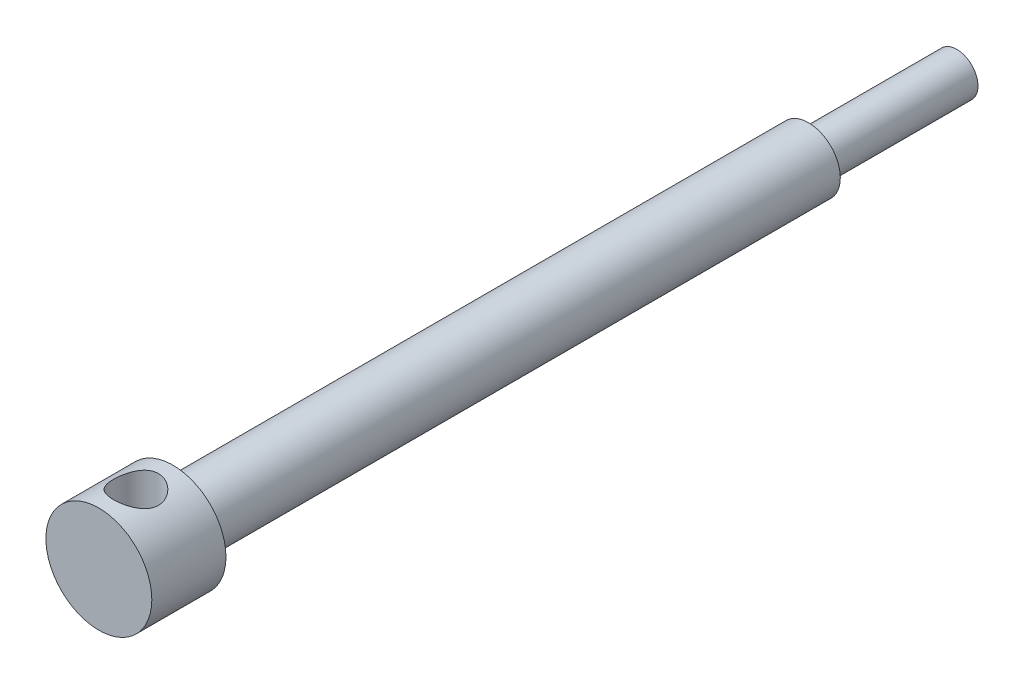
ISO-10303-21;
HEADER;
FILE_DESCRIPTION(('STEP AP214'),'2;1');
FILE_NAME('part.step','',(''),(''),'','','');
FILE_SCHEMA(('AUTOMOTIVE_DESIGN { 1 0 10303 214 1 1 1 1 }'));
ENDSEC;
DATA;
#1=APPLICATION_CONTEXT('core data for automotive mechanical design processes');
#2=APPLICATION_PROTOCOL_DEFINITION('international standard','automotive_design',2000,#1);
#3=PRODUCT_CONTEXT('',#1,'mechanical');
#4=PRODUCT('Part','Part','',(#3));
#5=PRODUCT_RELATED_PRODUCT_CATEGORY('part','',(#4));
#6=PRODUCT_DEFINITION_FORMATION('','',#4);
#7=PRODUCT_DEFINITION_CONTEXT('part definition',#1,'design');
#8=PRODUCT_DEFINITION('design','',#6,#7);
#9=PRODUCT_DEFINITION_SHAPE('','',#8);
#10=(LENGTH_UNIT() NAMED_UNIT(*) SI_UNIT(.MILLI.,.METRE.));
#11=(NAMED_UNIT(*) PLANE_ANGLE_UNIT() SI_UNIT($,.RADIAN.));
#12=(NAMED_UNIT(*) SI_UNIT($,.STERADIAN.) SOLID_ANGLE_UNIT());
#13=UNCERTAINTY_MEASURE_WITH_UNIT(LENGTH_MEASURE(1.E-05),#10,'distance_accuracy_value','');
#14=(GEOMETRIC_REPRESENTATION_CONTEXT(3) GLOBAL_UNCERTAINTY_ASSIGNED_CONTEXT((#13)) GLOBAL_UNIT_ASSIGNED_CONTEXT((#10,
#11,#12)) REPRESENTATION_CONTEXT('',''));
#15=CARTESIAN_POINT('',(0.,0.,0.));
#16=DIRECTION('',(0.,0.,1.));
#17=DIRECTION('',(1.,0.,0.));
#18=AXIS2_PLACEMENT_3D('',#15,#16,#17);
#19=CARTESIAN_POINT('',(0.,-1.38777878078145E-13,5.55625000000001));
#20=DIRECTION('',(0.,0.,-0.999999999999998));
#21=DIRECTION('',(-1.,0.,0.));
#22=AXIS2_PLACEMENT_3D('',#19,#20,#21);
#23=PLANE('',#22);
#24=CARTESIAN_POINT('',(0.,-1.38777878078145E-13,5.55624999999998));
#25=DIRECTION('',(0.,0.,0.999999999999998));
#26=DIRECTION('',(1.,0.,0.));
#27=AXIS2_PLACEMENT_3D('',#24,#25,#26);
#28=CIRCLE('',#27,7.9375);
#29=CARTESIAN_POINT('',(7.93749999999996,-1.38881148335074E-13,5.55624999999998));
#30=VERTEX_POINT('',#29);
#31=EDGE_CURVE('E61',#30,#30,#28,.T.);
#32=ORIENTED_EDGE('',*,*,#31,.T.);
#33=EDGE_LOOP('',(#32));
#34=FACE_BOUND('',#33,.T.);
#35=ADVANCED_FACE('F47',(#34),#23,.F.);
#36=CARTESIAN_POINT('',(0.,0.,83.2642583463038));
#37=DIRECTION('',(0.,0.,0.999999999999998));
#38=DIRECTION('',(1.,0.,0.));
#39=AXIS2_PLACEMENT_3D('',#36,#37,#38);
#40=CYLINDRICAL_SURFACE('',#39,7.9375);
#41=CARTESIAN_POINT('',(0.,7.93749999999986,-3.37820000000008));
#42=CARTESIAN_POINT('',(0.0903479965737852,7.93749921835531,-3.37819894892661));
#43=CARTESIAN_POINT('',(0.18072842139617,7.9359516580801,-3.37456818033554));
#44=CARTESIAN_POINT('',(0.360820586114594,7.92980863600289,-3.36009332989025));
#45=CARTESIAN_POINT('',(0.450531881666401,7.92521130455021,-3.34924482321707));
#46=CARTESIAN_POINT('',(0.717999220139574,7.9069718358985,-3.30594696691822));
#47=CARTESIAN_POINT('',(0.893851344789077,7.88888264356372,-3.26274560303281));
#48=CARTESIAN_POINT('',(1.23451569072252,7.84279490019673,-3.14966381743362));
#49=CARTESIAN_POINT('',(1.39936368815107,7.81483052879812,-3.07987535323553));
#50=CARTESIAN_POINT('',(1.71488574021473,7.75170651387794,-2.91598917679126));
#51=CARTESIAN_POINT('',(1.86556373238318,7.71654887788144,-2.82189824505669));
#52=CARTESIAN_POINT('',(2.15648729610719,7.64049449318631,-2.60692463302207));
#53=CARTESIAN_POINT('',(2.2958984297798,7.59940456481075,-2.48498240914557));
#54=CARTESIAN_POINT('',(2.5530170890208,7.51693240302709,-2.2200106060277));
#55=CARTESIAN_POINT('',(2.67071272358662,7.47555002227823,-2.07696955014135));
#56=CARTESIAN_POINT('',(2.8870956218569,7.39477034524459,-1.76487865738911));
#57=CARTESIAN_POINT('',(2.98448088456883,7.35558722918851,-1.59486481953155));
#58=CARTESIAN_POINT('',(3.1488994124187,7.28672375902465,-1.23896424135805));
#59=CARTESIAN_POINT('',(3.21594897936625,7.25703830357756,-1.05308609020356));
#60=CARTESIAN_POINT('',(3.31431098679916,7.21263114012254,-0.68033343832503));
#61=CARTESIAN_POINT('',(3.3472321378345,7.19723980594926,-0.493966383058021));
#62=CARTESIAN_POINT('',(3.38141729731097,7.18124765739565,-0.117767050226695));
#63=CARTESIAN_POINT('',(3.38269987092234,7.18063816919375,0.0720631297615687));
#64=CARTESIAN_POINT('',(3.35477924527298,7.19371438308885,0.433447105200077));
#65=CARTESIAN_POINT('',(3.328026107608,7.20625127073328,0.605240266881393));
#66=CARTESIAN_POINT('',(3.24891661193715,7.24225901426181,0.941616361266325));
#67=CARTESIAN_POINT('',(3.19655509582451,7.26573207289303,1.10619783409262));
#68=CARTESIAN_POINT('',(3.0666857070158,7.32150346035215,1.42772603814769));
#69=CARTESIAN_POINT('',(2.98865688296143,7.35398222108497,1.58442963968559));
#70=CARTESIAN_POINT('',(2.81003790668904,7.42406784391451,1.88314584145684));
#71=CARTESIAN_POINT('',(2.70943864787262,7.46167677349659,2.02515247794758));
#72=CARTESIAN_POINT('',(2.4780852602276,7.54183359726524,2.30367767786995));
#73=CARTESIAN_POINT('',(2.34544987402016,7.58452396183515,2.43859714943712));
#74=CARTESIAN_POINT('',(2.05903146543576,7.66723558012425,2.68482798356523));
#75=CARTESIAN_POINT('',(1.90524307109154,7.70725615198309,2.79613333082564));
#76=CARTESIAN_POINT('',(1.57584493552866,7.78137408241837,2.99446150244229));
#77=CARTESIAN_POINT('',(1.39978537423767,7.81529812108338,3.08080684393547));
#78=CARTESIAN_POINT('',(1.03382604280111,7.87205858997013,3.22208745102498));
#79=CARTESIAN_POINT('',(0.843934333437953,7.89490141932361,3.27704084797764));
#80=CARTESIAN_POINT('',(0.469041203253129,7.92571423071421,3.35056820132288));
#81=CARTESIAN_POINT('',(0.284532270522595,7.9345592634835,3.37128649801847));
#82=CARTESIAN_POINT('',(-0.0855241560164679,7.93919331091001,3.38218199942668));
#83=CARTESIAN_POINT('',(-0.271071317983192,7.9349862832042,3.37236846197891));
#84=CARTESIAN_POINT('',(-0.627716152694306,7.91455288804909,3.32398965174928));
#85=CARTESIAN_POINT('',(-0.799062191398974,7.89896617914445,3.28695383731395));
#86=CARTESIAN_POINT('',(-1.1329062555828,7.85803616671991,3.18733677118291));
#87=CARTESIAN_POINT('',(-1.29540317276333,7.83269164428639,3.12475232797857));
#88=CARTESIAN_POINT('',(-1.61266971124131,7.77367766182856,2.97377887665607));
#89=CARTESIAN_POINT('',(-1.76704004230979,7.73977312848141,2.88464566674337));
#90=CARTESIAN_POINT('',(-2.05918825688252,7.66722534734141,2.68391949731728));
#91=CARTESIAN_POINT('',(-2.19695905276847,7.62858008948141,2.57231699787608));
#92=CARTESIAN_POINT('',(-2.4627821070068,7.54714188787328,2.3201184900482));
#93=CARTESIAN_POINT('',(-2.58934863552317,7.5042542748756,2.17798310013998));
#94=CARTESIAN_POINT('',(-2.81727466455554,7.42169794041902,1.87385172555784));
#95=CARTESIAN_POINT('',(-2.91862748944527,7.38203007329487,1.71185049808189));
#96=CARTESIAN_POINT('',(-3.09461833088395,7.31002572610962,1.36870550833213));
#97=CARTESIAN_POINT('',(-3.1687733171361,7.2778252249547,1.18728332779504));
#98=CARTESIAN_POINT('',(-3.28482494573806,7.22619815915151,0.812719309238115));
#99=CARTESIAN_POINT('',(-3.32674974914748,7.20676044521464,0.619587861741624));
#100=CARTESIAN_POINT('',(-3.37429595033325,7.18461257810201,0.243645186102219));
#101=CARTESIAN_POINT('',(-3.38254073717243,7.18069440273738,0.0612356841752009));
#102=CARTESIAN_POINT('',(-3.36955829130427,7.18679611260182,-0.302274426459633));
#103=CARTESIAN_POINT('',(-3.3483360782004,7.19681362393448,-0.483375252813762));
#104=CARTESIAN_POINT('',(-3.27925702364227,7.22853365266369,-0.829648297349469));
#105=CARTESIAN_POINT('',(-3.23280392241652,7.2496185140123,-0.995162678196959));
#106=CARTESIAN_POINT('',(-3.11598713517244,7.30058688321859,-1.31606926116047));
#107=CARTESIAN_POINT('',(-3.04561667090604,7.3304728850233,-1.47145857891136));
#108=CARTESIAN_POINT('',(-2.87798847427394,7.39795381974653,-1.77814952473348));
#109=CARTESIAN_POINT('',(-2.77934285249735,7.43590992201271,-1.92861142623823));
#110=CARTESIAN_POINT('',(-2.55985430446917,7.51429404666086,-2.21166811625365));
#111=CARTESIAN_POINT('',(-2.43900315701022,7.55472298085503,-2.34425625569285));
#112=CARTESIAN_POINT('',(-2.16748234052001,7.63724946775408,-2.59835694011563));
#113=CARTESIAN_POINT('',(-2.01522911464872,7.67923413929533,-2.71821908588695));
#114=CARTESIAN_POINT('',(-1.69112746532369,7.75703956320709,-2.93083940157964));
#115=CARTESIAN_POINT('',(-1.51927020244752,7.79285751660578,-3.02358527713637));
#116=CARTESIAN_POINT('',(-1.25180008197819,7.83868597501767,-3.13919208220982));
#117=CARTESIAN_POINT('',(-1.16170048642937,7.85257459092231,-3.17364606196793));
#118=CARTESIAN_POINT('',(-0.978540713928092,7.8774919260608,-3.23480995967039));
#119=CARTESIAN_POINT('',(-0.88548197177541,7.8885220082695,-3.26152356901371));
#120=CARTESIAN_POINT('',(-0.697348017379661,7.90737221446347,-3.30685448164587));
#121=CARTESIAN_POINT('',(-0.602278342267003,7.91520018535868,-3.32549158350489));
#122=CARTESIAN_POINT('',(-0.410719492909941,7.92744670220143,-3.35453658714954));
#123=CARTESIAN_POINT('',(-0.314231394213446,7.93186770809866,-3.36495042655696));
#124=CARTESIAN_POINT('',(-0.181274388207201,7.93551261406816,-3.37352812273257));
#125=CARTESIAN_POINT('',(-0.14504727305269,7.9362574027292,-3.37527950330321));
#126=CARTESIAN_POINT('',(-0.0725485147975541,7.93725125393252,-3.37761565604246));
#127=CARTESIAN_POINT('',(-0.0362768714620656,7.93750031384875,-3.3782004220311));
#128=CARTESIAN_POINT('',(0.,7.93749999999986,-3.37820000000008));
#129=B_SPLINE_CURVE_WITH_KNOTS('',3,(#41,#42,#43,#44,#45,#46,#47,#48,#49,#50,#51,#52,#53,#54,
#55,#56,#57,#58,#59,#60,#61,#62,#63,#64,#65,#66,#67,#68,#69,#70,#71,#72,#73,#74,#75,#76,#77,#78,
#79,#80,#81,#82,#83,#84,#85,#86,#87,#88,#89,#90,#91,#92,#93,#94,#95,#96,#97,#98,#99,#100,#101,
#102,#103,#104,#105,#106,#107,#108,#109,#110,#111,#112,#113,#114,#115,#116,#117,#118,#119,#120,
#121,#122,#123,#124,#125,#126,#127,#128),.UNSPECIFIED.,.T.,.F.,(4,2,2,2,2,2,2,2,2,2,2,2,2,2,2,2,
2,2,2,2,2,2,2,2,2,2,2,2,2,2,2,2,2,2,2,2,2,2,2,2,2,2,2,4),(0.,0.271004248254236,
0.542174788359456,1.08521849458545,1.62640076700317,2.16743220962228,2.73413926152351,
3.30115571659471,3.89757199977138,4.49366739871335,5.06017388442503,5.62634794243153,
6.14686517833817,6.66748730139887,7.19940537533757,7.73153845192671,8.31078556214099,
8.89018004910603,9.48407597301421,10.0776285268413,10.6323592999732,11.1869218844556,
11.7125013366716,12.2381464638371,12.780192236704,13.3224686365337,13.9050914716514,
14.4878683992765,15.0805445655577,15.6727022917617,16.2177386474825,16.762682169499,
17.2800195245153,17.797503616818,18.3468266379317,18.8963534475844,19.4883935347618,
20.0807016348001,20.3727491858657,20.6646572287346,20.9558455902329,21.2468235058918,
21.3556375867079,21.464452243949),.UNSPECIFIED.);
#130=CARTESIAN_POINT('',(0.,7.93749999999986,-3.37820000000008));
#131=VERTEX_POINT('',#130);
#132=EDGE_CURVE('E10',#131,#131,#129,.T.);
#133=ORIENTED_EDGE('',*,*,#132,.T.);
#134=EDGE_LOOP('',(#133));
#135=FACE_BOUND('',#134,.T.);
#136=CARTESIAN_POINT('',(0.,-7.93750000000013,-3.37820000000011));
#137=CARTESIAN_POINT('',(-0.0903479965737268,-7.93749921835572,-3.37819894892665));
#138=CARTESIAN_POINT('',(-0.180728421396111,-7.9359516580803,-3.37456818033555));
#139=CARTESIAN_POINT('',(-0.360820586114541,-7.9298086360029,-3.36009332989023));
#140=CARTESIAN_POINT('',(-0.450531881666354,-7.92521130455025,-3.34924482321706));
#141=CARTESIAN_POINT('',(-0.717999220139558,-7.90697183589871,-3.30594696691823));
#142=CARTESIAN_POINT('',(-0.893851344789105,-7.8888826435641,-3.26274560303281));
#143=CARTESIAN_POINT('',(-1.23451569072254,-7.84279490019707,-3.14966381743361));
#144=CARTESIAN_POINT('',(-1.39936368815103,-7.81483052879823,-3.0798753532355));
#145=CARTESIAN_POINT('',(-1.71488574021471,-7.75170651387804,-2.91598917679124));
#146=CARTESIAN_POINT('',(-1.86556373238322,-7.71654887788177,-2.82189824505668));
#147=CARTESIAN_POINT('',(-2.15648729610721,-7.64049449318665,-2.60692463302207));
#148=CARTESIAN_POINT('',(-2.29589842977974,-7.59940456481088,-2.48498240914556));
#149=CARTESIAN_POINT('',(-2.55301708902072,-7.51693240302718,-2.22001060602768));
#150=CARTESIAN_POINT('',(-2.6707127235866,-7.47555002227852,-2.07696955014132));
#151=CARTESIAN_POINT('',(-2.88709562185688,-7.39477034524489,-1.76487865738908));
#152=CARTESIAN_POINT('',(-2.98448088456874,-7.35558722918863,-1.5948648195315));
#153=CARTESIAN_POINT('',(-3.14889941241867,-7.28672375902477,-1.238964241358));
#154=CARTESIAN_POINT('',(-3.21594897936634,-7.25703830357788,-1.05308609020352));
#155=CARTESIAN_POINT('',(-3.31431098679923,-7.21263114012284,-0.680333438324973));
#156=CARTESIAN_POINT('',(-3.34723213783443,-7.19723980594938,-0.493966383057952));
#157=CARTESIAN_POINT('',(-3.38141729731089,-7.18124765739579,-0.117767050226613));
#158=CARTESIAN_POINT('',(-3.38269987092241,-7.1806381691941,0.072063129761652));
#159=CARTESIAN_POINT('',(-3.35477924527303,-7.19371438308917,0.433447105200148));
#160=CARTESIAN_POINT('',(-3.32802610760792,-7.20625127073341,0.60524026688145));
#161=CARTESIAN_POINT('',(-3.24891661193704,-7.24225901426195,0.941616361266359));
#162=CARTESIAN_POINT('',(-3.19655509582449,-7.26573207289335,1.10619783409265));
#163=CARTESIAN_POINT('',(-3.0666857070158,-7.32150346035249,1.42772603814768));
#164=CARTESIAN_POINT('',(-2.98865688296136,-7.35398222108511,1.58442963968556));
#165=CARTESIAN_POINT('',(-2.81003790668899,-7.4240678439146,1.88314584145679));
#166=CARTESIAN_POINT('',(-2.70943864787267,-7.46167677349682,2.02515247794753));
#167=CARTESIAN_POINT('',(-2.47808526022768,-7.54183359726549,2.30367767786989));
#168=CARTESIAN_POINT('',(-2.34544987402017,-7.58452396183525,2.43859714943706));
#169=CARTESIAN_POINT('',(-2.05903146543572,-7.66723558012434,2.68482798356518));
#170=CARTESIAN_POINT('',(-1.90524307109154,-7.70725615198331,2.79613333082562));
#171=CARTESIAN_POINT('',(-1.57584493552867,-7.78137408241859,2.99446150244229));
#172=CARTESIAN_POINT('',(-1.39978537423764,-7.81529812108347,3.08080684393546));
#173=CARTESIAN_POINT('',(-1.03382604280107,-7.87205858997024,3.22208745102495));
#174=CARTESIAN_POINT('',(-0.843934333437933,-7.89490141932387,3.27704084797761));
#175=CARTESIAN_POINT('',(-0.469041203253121,-7.92571423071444,3.35056820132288));
#176=CARTESIAN_POINT('',(-0.28453227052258,-7.93455926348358,3.37128649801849));
#177=CARTESIAN_POINT('',(0.0855241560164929,-7.93919331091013,3.38218199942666));
#178=CARTESIAN_POINT('',(0.27107131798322,-7.9349862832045,3.37236846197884));
#179=CARTESIAN_POINT('',(0.627716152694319,-7.91455288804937,3.32398965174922));
#180=CARTESIAN_POINT('',(0.79906219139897,-7.89896617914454,3.28695383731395));
#181=CARTESIAN_POINT('',(1.13290625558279,-7.85803616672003,3.18733677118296));
#182=CARTESIAN_POINT('',(1.29540317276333,-7.83269164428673,3.12475232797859));
#183=CARTESIAN_POINT('',(1.6126697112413,-7.77367766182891,2.97377887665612));
#184=CARTESIAN_POINT('',(1.76704004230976,-7.73977312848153,2.88464566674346));
#185=CARTESIAN_POINT('',(2.05918825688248,-7.66722534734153,2.68391949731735));
#186=CARTESIAN_POINT('',(2.19695905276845,-7.62858008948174,2.57231699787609));
#187=CARTESIAN_POINT('',(2.46278210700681,-7.54714188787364,2.32011849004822));
#188=CARTESIAN_POINT('',(2.5893486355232,-7.50425427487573,2.17798310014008));
#189=CARTESIAN_POINT('',(2.81727466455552,-7.42169794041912,1.87385172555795));
#190=CARTESIAN_POINT('',(2.91862748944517,-7.38203007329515,1.71185049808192));
#191=CARTESIAN_POINT('',(3.09461833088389,-7.31002572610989,1.36870550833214));
#192=CARTESIAN_POINT('',(3.16877331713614,-7.27782522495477,1.18728332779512));
#193=CARTESIAN_POINT('',(3.28482494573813,-7.22619815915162,0.812719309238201));
#194=CARTESIAN_POINT('',(3.32674974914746,-7.20676044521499,0.619587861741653));
#195=CARTESIAN_POINT('',(3.37429595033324,-7.18461257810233,0.243645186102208));
#196=CARTESIAN_POINT('',(3.3825407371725,-7.18069440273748,0.0612356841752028));
#197=CARTESIAN_POINT('',(3.36955829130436,-7.18679611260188,-0.302274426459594));
#198=CARTESIAN_POINT('',(3.34833607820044,-7.19681362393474,-0.483375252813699));
#199=CARTESIAN_POINT('',(3.27925702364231,-7.22853365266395,-0.829648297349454));
#200=CARTESIAN_POINT('',(3.23280392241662,-7.24961851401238,-0.99516267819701));
#201=CARTESIAN_POINT('',(3.11598713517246,-7.30058688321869,-1.31606926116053));
#202=CARTESIAN_POINT('',(3.04561667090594,-7.33047288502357,-1.47145857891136));
#203=CARTESIAN_POINT('',(2.87798847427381,-7.39795381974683,-1.7781495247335));
#204=CARTESIAN_POINT('',(2.77934285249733,-7.43590992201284,-1.92861142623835));
#205=CARTESIAN_POINT('',(2.55985430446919,-7.51429404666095,-2.21166811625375));
#206=CARTESIAN_POINT('',(2.43900315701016,-7.55472298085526,-2.34425625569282));
#207=CARTESIAN_POINT('',(2.16748234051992,-7.63724946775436,-2.59835694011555));
#208=CARTESIAN_POINT('',(2.01522911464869,-7.67923413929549,-2.71821908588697));
#209=CARTESIAN_POINT('',(1.6911274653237,-7.75703956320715,-2.93083940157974));
#210=CARTESIAN_POINT('',(1.51927020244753,-7.79285751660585,-3.02358527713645));
#211=CARTESIAN_POINT('',(1.25180008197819,-7.83868597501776,-3.13919208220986));
#212=CARTESIAN_POINT('',(1.16170048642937,-7.8525745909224,-3.17364606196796));
#213=CARTESIAN_POINT('',(0.978540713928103,-7.87749192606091,-3.23480995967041));
#214=CARTESIAN_POINT('',(0.885481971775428,-7.88852200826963,-3.26152356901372));
#215=CARTESIAN_POINT('',(0.697348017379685,-7.90737221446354,-3.30685448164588));
#216=CARTESIAN_POINT('',(0.602278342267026,-7.91520018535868,-3.3254915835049));
#217=CARTESIAN_POINT('',(0.410719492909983,-7.92744670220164,-3.35453658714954));
#218=CARTESIAN_POINT('',(0.314231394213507,-7.93186770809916,-3.36495042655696));
#219=CARTESIAN_POINT('',(0.181274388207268,-7.93551261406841,-3.37352812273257));
#220=CARTESIAN_POINT('',(0.145047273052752,-7.93625740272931,-3.37527950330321));
#221=CARTESIAN_POINT('',(0.0725485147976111,-7.93725125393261,-3.37761565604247));
#222=CARTESIAN_POINT('',(0.036276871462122,-7.93750031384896,-3.37820042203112));
#223=CARTESIAN_POINT('',(0.,-7.93750000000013,-3.37820000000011));
#224=B_SPLINE_CURVE_WITH_KNOTS('',3,(#136,#137,#138,#139,#140,#141,#142,#143,#144,#145,#146,
#147,#148,#149,#150,#151,#152,#153,#154,#155,#156,#157,#158,#159,#160,#161,#162,#163,#164,#165,
#166,#167,#168,#169,#170,#171,#172,#173,#174,#175,#176,#177,#178,#179,#180,#181,#182,#183,#184,
#185,#186,#187,#188,#189,#190,#191,#192,#193,#194,#195,#196,#197,#198,#199,#200,#201,#202,#203,
#204,#205,#206,#207,#208,#209,#210,#211,#212,#213,#214,#215,#216,#217,#218,#219,#220,#221,#222,
#223),.UNSPECIFIED.,.T.,.F.,(4,2,2,2,2,2,2,2,2,2,2,2,2,2,2,2,2,2,2,2,2,2,2,2,2,2,2,2,2,2,2,2,2,
2,2,2,2,2,2,2,2,2,2,4),(0.,0.271004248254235,0.542174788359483,1.08521849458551,
1.62640076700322,2.16743220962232,2.73413926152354,3.30115571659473,3.89757199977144,
4.49366739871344,5.06017388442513,5.62634794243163,6.14686517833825,6.66748730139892,
7.19940537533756,7.73153845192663,8.31078556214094,8.89018004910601,9.48407597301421,
10.0776285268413,10.6323592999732,11.1869218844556,11.7125013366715,12.238146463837,
12.7801922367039,13.3224686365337,13.9050914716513,14.4878683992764,15.0805445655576,
15.6727022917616,16.2177386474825,16.7626821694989,17.2800195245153,17.7975036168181,
18.3468266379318,18.8963534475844,19.4883935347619,20.0807016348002,20.3727491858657,
20.6646572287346,20.9558455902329,21.2468235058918,21.3556375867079,21.4644522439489),.UNSPECIFIED.);
#225=CARTESIAN_POINT('',(0.,-7.93750000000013,-3.37820000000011));
#226=VERTEX_POINT('',#225);
#227=EDGE_CURVE('E57',#226,#226,#224,.T.);
#228=ORIENTED_EDGE('',*,*,#227,.T.);
#229=EDGE_LOOP('',(#228));
#230=FACE_BOUND('',#229,.T.);
#231=ORIENTED_EDGE('',*,*,#31,.F.);
#232=EDGE_LOOP('',(#231));
#233=FACE_BOUND('',#232,.T.);
#234=CARTESIAN_POINT('',(0.,-1.94289029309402E-13,-5.55624999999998));
#235=DIRECTION('',(0.,0.,0.999999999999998));
#236=DIRECTION('',(1.,0.,0.));
#237=AXIS2_PLACEMENT_3D('',#234,#235,#236);
#238=CIRCLE('',#237,7.9375);
#239=CARTESIAN_POINT('',(7.93750000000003,-1.94392299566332E-13,-5.55624999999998));
#240=VERTEX_POINT('',#239);
#241=EDGE_CURVE('E65',#240,#240,#238,.T.);
#242=ORIENTED_EDGE('',*,*,#241,.T.);
#243=EDGE_LOOP('',(#242));
#244=FACE_BOUND('',#243,.T.);
#245=ADVANCED_FACE('F71',(#135,#230,#233,#244),#40,.T.);
#246=CARTESIAN_POINT('',(0.,7.93749999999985,-5.55625000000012));
#247=DIRECTION('',(0.,0.,0.999999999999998));
#248=DIRECTION('',(1.,0.,0.));
#249=AXIS2_PLACEMENT_3D('',#246,#247,#248);
#250=PLANE('',#249);
#251=ORIENTED_EDGE('',*,*,#241,.F.);
#252=EDGE_LOOP('',(#251));
#253=FACE_BOUND('',#252,.T.);
#254=CARTESIAN_POINT('',(0.,-1.94289029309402E-13,-5.55624999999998));
#255=DIRECTION('',(0.,0.,0.999999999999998));
#256=DIRECTION('',(1.,0.,0.));
#257=AXIS2_PLACEMENT_3D('',#254,#255,#256);
#258=CIRCLE('',#257,4.7625);
#259=CARTESIAN_POINT('',(4.76250000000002,0.,-5.55624999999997));
#260=VERTEX_POINT('',#259);
#261=EDGE_CURVE('E112',#260,#260,#258,.T.);
#262=ORIENTED_EDGE('',*,*,#261,.T.);
#263=EDGE_LOOP('',(#262));
#264=FACE_BOUND('',#263,.T.);
#265=ADVANCED_FACE('F94',(#253,#264),#250,.F.);
#266=CARTESIAN_POINT('',(0.,0.,83.2642583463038));
#267=DIRECTION('',(0.,0.,0.999999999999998));
#268=DIRECTION('',(1.,0.,0.));
#269=AXIS2_PLACEMENT_3D('',#266,#267,#268);
#270=CYLINDRICAL_SURFACE('',#269,4.7625);
#271=CARTESIAN_POINT('',(0.,-1.80411241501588E-13,-100.80625));
#272=DIRECTION('',(0.,0.,0.999999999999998));
#273=DIRECTION('',(1.,0.,0.));
#274=AXIS2_PLACEMENT_3D('',#271,#272,#273);
#275=CIRCLE('',#274,4.7625);
#276=CARTESIAN_POINT('',(4.76250000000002,0.,-100.80625));
#277=VERTEX_POINT('',#276);
#278=EDGE_CURVE('E114',#277,#277,#275,.T.);
#279=CARTESIAN_POINT('',(4.76250000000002,0.,-5.55624999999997));
#280=CARTESIAN_POINT('',(4.76250000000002,0.,-6.54843749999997));
#281=CARTESIAN_POINT('',(4.76250000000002,0.,-7.54062499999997));
#282=CARTESIAN_POINT('',(4.76250000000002,0.,-9.52499999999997));
#283=CARTESIAN_POINT('',(4.76250000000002,0.,-10.5171875));
#284=CARTESIAN_POINT('',(4.76250000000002,0.,-12.5015625));
#285=CARTESIAN_POINT('',(4.76250000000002,0.,-13.49375));
#286=CARTESIAN_POINT('',(4.76250000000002,0.,-15.478125));
#287=CARTESIAN_POINT('',(4.76250000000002,0.,-16.4703125));
#288=CARTESIAN_POINT('',(4.76250000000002,0.,-18.4546875));
#289=CARTESIAN_POINT('',(4.76250000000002,0.,-19.446875));
#290=CARTESIAN_POINT('',(4.76250000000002,0.,-21.43125));
#291=CARTESIAN_POINT('',(4.76250000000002,0.,-22.4234375));
#292=CARTESIAN_POINT('',(4.76250000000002,0.,-24.4078125));
#293=CARTESIAN_POINT('',(4.76250000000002,0.,-25.4));
#294=CARTESIAN_POINT('',(4.76250000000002,0.,-27.384375));
#295=CARTESIAN_POINT('',(4.76250000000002,0.,-28.3765625));
#296=CARTESIAN_POINT('',(4.76250000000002,0.,-30.3609375));
#297=CARTESIAN_POINT('',(4.76250000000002,0.,-31.3531249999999));
#298=CARTESIAN_POINT('',(4.76250000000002,0.,-33.3374999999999));
#299=CARTESIAN_POINT('',(4.76250000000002,0.,-34.3296874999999));
#300=CARTESIAN_POINT('',(4.76250000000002,0.,-36.3140624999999));
#301=CARTESIAN_POINT('',(4.76250000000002,0.,-37.3062499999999));
#302=CARTESIAN_POINT('',(4.76250000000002,0.,-39.2906249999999));
#303=CARTESIAN_POINT('',(4.76250000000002,0.,-40.2828124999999));
#304=CARTESIAN_POINT('',(4.76250000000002,0.,-42.2671874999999));
#305=CARTESIAN_POINT('',(4.76250000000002,0.,-43.259375));
#306=CARTESIAN_POINT('',(4.76250000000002,0.,-45.2437499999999));
#307=CARTESIAN_POINT('',(4.76250000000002,0.,-46.2359375));
#308=CARTESIAN_POINT('',(4.76250000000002,0.,-48.2203124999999));
#309=CARTESIAN_POINT('',(4.76250000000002,0.,-49.2124999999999));
#310=CARTESIAN_POINT('',(4.76250000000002,0.,-51.1968749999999));
#311=CARTESIAN_POINT('',(4.76250000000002,0.,-52.1890624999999));
#312=CARTESIAN_POINT('',(4.76250000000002,0.,-54.1734374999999));
#313=CARTESIAN_POINT('',(4.76250000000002,0.,-55.1656249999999));
#314=CARTESIAN_POINT('',(4.76250000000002,0.,-57.1499999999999));
#315=CARTESIAN_POINT('',(4.76250000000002,0.,-58.1421874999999));
#316=CARTESIAN_POINT('',(4.76250000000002,0.,-60.1265624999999));
#317=CARTESIAN_POINT('',(4.76250000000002,0.,-61.1187499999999));
#318=CARTESIAN_POINT('',(4.76250000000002,0.,-63.1031249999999));
#319=CARTESIAN_POINT('',(4.76250000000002,0.,-64.0953124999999));
#320=CARTESIAN_POINT('',(4.76250000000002,0.,-66.0796874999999));
#321=CARTESIAN_POINT('',(4.76250000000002,0.,-67.0718749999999));
#322=CARTESIAN_POINT('',(4.76250000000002,0.,-69.0562499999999));
#323=CARTESIAN_POINT('',(4.76250000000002,0.,-70.0484374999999));
#324=CARTESIAN_POINT('',(4.76250000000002,0.,-72.0328124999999));
#325=CARTESIAN_POINT('',(4.76250000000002,0.,-73.0249999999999));
#326=CARTESIAN_POINT('',(4.76250000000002,0.,-75.0093749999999));
#327=CARTESIAN_POINT('',(4.76250000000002,0.,-76.0015624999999));
#328=CARTESIAN_POINT('',(4.76250000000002,0.,-77.9859374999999));
#329=CARTESIAN_POINT('',(4.76250000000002,0.,-78.9781249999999));
#330=CARTESIAN_POINT('',(4.76250000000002,0.,-80.9624999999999));
#331=CARTESIAN_POINT('',(4.76250000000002,0.,-81.9546874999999));
#332=CARTESIAN_POINT('',(4.76250000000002,0.,-83.9390624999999));
#333=CARTESIAN_POINT('',(4.76250000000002,0.,-84.9312499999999));
#334=CARTESIAN_POINT('',(4.76250000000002,0.,-86.9156249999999));
#335=CARTESIAN_POINT('',(4.76250000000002,0.,-87.9078124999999));
#336=CARTESIAN_POINT('',(4.76250000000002,0.,-89.8921874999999));
#337=CARTESIAN_POINT('',(4.76250000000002,0.,-90.8843749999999));
#338=CARTESIAN_POINT('',(4.76250000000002,0.,-92.8687499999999));
#339=CARTESIAN_POINT('',(4.76250000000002,0.,-93.8609374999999));
#340=CARTESIAN_POINT('',(4.76250000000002,0.,-95.8453124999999));
#341=CARTESIAN_POINT('',(4.76250000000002,0.,-96.8374999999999));
#342=CARTESIAN_POINT('',(4.76250000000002,0.,-98.8218749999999));
#343=CARTESIAN_POINT('',(4.76250000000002,0.,-99.8140624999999));
#344=CARTESIAN_POINT('',(4.76250000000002,0.,-100.80625));
#345=B_SPLINE_CURVE_WITH_KNOTS('',3,(#279,#280,#281,#282,#283,#284,#285,#286,#287,#288,#289,
#290,#291,#292,#293,#294,#295,#296,#297,#298,#299,#300,#301,#302,#303,#304,#305,#306,#307,#308,
#309,#310,#311,#312,#313,#314,#315,#316,#317,#318,#319,#320,#321,#322,#323,#324,#325,#326,#327,
#328,#329,#330,#331,#332,#333,#334,#335,#336,#337,#338,#339,#340,#341,#342,#343,#344),
.UNSPECIFIED.,.F.,.F.,(4,2,2,2,2,2,2,2,2,2,2,2,2,2,2,2,2,2,2,2,2,2,2,2,2,2,2,2,2,2,2,2,4),(0.,
2.9765625,5.95312499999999,8.92968749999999,11.90625,14.8828125,17.859375,20.8359375,23.8125,
26.7890625,29.765625,32.7421875,35.71875,38.6953125,41.671875,44.6484375,47.625,50.6015625,
53.578125,56.5546875,59.5312499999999,62.5078125,65.484375,68.4609375,71.4374999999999,
74.4140624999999,77.3906249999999,80.3671875,83.34375,86.3203124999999,89.2968749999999,
92.2734374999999,95.2499999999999),.UNSPECIFIED.);
#346=EDGE_CURVE('BSEAM91',#260,#277,#345,.T.);
#347=ORIENTED_EDGE('',*,*,#261,.F.);
#348=ORIENTED_EDGE('',*,*,#278,.T.);
#349=ORIENTED_EDGE('',*,*,#346,.T.);
#350=ORIENTED_EDGE('',*,*,#346,.F.);
#351=EDGE_LOOP('',(#347,#349,#348,#350));
#352=FACE_BOUND('',#351,.T.);
#353=ADVANCED_FACE('F91',(#352),#270,.T.);
#354=CARTESIAN_POINT('',(0.,4.76249999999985,-100.80625));
#355=DIRECTION('',(0.,0.,0.999999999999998));
#356=DIRECTION('',(1.,0.,0.));
#357=AXIS2_PLACEMENT_3D('',#354,#355,#356);
#358=PLANE('',#357);
#359=ORIENTED_EDGE('',*,*,#278,.F.);
#360=EDGE_LOOP('',(#359));
#361=FACE_BOUND('',#360,.T.);
#362=CARTESIAN_POINT('',(0.,-1.80411241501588E-13,-100.80625));
#363=DIRECTION('',(0.,0.,0.999999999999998));
#364=DIRECTION('',(1.,0.,0.));
#365=AXIS2_PLACEMENT_3D('',#362,#363,#364);
#366=CIRCLE('',#365,3.175);
#367=CARTESIAN_POINT('',(3.17500000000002,0.,-100.80625));
#368=VERTEX_POINT('',#367);
#369=EDGE_CURVE('E119',#368,#368,#366,.T.);
#370=ORIENTED_EDGE('',*,*,#369,.T.);
#371=EDGE_LOOP('',(#370));
#372=FACE_BOUND('',#371,.T.);
#373=ADVANCED_FACE('F87',(#361,#372),#358,.F.);
#374=CARTESIAN_POINT('',(0.,0.,83.2642583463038));
#375=DIRECTION('',(0.,0.,0.999999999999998));
#376=DIRECTION('',(1.,0.,0.));
#377=AXIS2_PLACEMENT_3D('',#374,#375,#376);
#378=CYLINDRICAL_SURFACE('',#377,3.175);
#379=CARTESIAN_POINT('',(0.,-1.66533453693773E-13,-123.03125));
#380=DIRECTION('',(0.,0.,0.999999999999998));
#381=DIRECTION('',(1.,0.,0.));
#382=AXIS2_PLACEMENT_3D('',#379,#380,#381);
#383=CIRCLE('',#382,3.175);
#384=CARTESIAN_POINT('',(3.17500000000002,0.,-123.03125));
#385=VERTEX_POINT('',#384);
#386=EDGE_CURVE('E122',#385,#385,#383,.T.);
#387=CARTESIAN_POINT('',(3.17500000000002,0.,-100.80625));
#388=CARTESIAN_POINT('',(3.17500000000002,0.,-101.037760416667));
#389=CARTESIAN_POINT('',(3.17500000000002,0.,-101.269270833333));
#390=CARTESIAN_POINT('',(3.17500000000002,0.,-101.732291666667));
#391=CARTESIAN_POINT('',(3.17500000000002,0.,-101.963802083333));
#392=CARTESIAN_POINT('',(3.17500000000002,0.,-102.426822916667));
#393=CARTESIAN_POINT('',(3.17500000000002,0.,-102.658333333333));
#394=CARTESIAN_POINT('',(3.17500000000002,0.,-103.121354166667));
#395=CARTESIAN_POINT('',(3.17500000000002,0.,-103.352864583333));
#396=CARTESIAN_POINT('',(3.17500000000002,0.,-103.815885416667));
#397=CARTESIAN_POINT('',(3.17500000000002,0.,-104.047395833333));
#398=CARTESIAN_POINT('',(3.17500000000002,0.,-104.510416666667));
#399=CARTESIAN_POINT('',(3.17500000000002,0.,-104.741927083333));
#400=CARTESIAN_POINT('',(3.17500000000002,0.,-105.204947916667));
#401=CARTESIAN_POINT('',(3.17500000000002,0.,-105.436458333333));
#402=CARTESIAN_POINT('',(3.17500000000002,0.,-105.899479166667));
#403=CARTESIAN_POINT('',(3.17500000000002,0.,-106.130989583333));
#404=CARTESIAN_POINT('',(3.17500000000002,0.,-106.594010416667));
#405=CARTESIAN_POINT('',(3.17500000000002,0.,-106.825520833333));
#406=CARTESIAN_POINT('',(3.17500000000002,0.,-107.288541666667));
#407=CARTESIAN_POINT('',(3.17500000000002,0.,-107.520052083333));
#408=CARTESIAN_POINT('',(3.17500000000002,0.,-107.983072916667));
#409=CARTESIAN_POINT('',(3.17500000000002,0.,-108.214583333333));
#410=CARTESIAN_POINT('',(3.17500000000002,0.,-108.677604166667));
#411=CARTESIAN_POINT('',(3.17500000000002,0.,-108.909114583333));
#412=CARTESIAN_POINT('',(3.17500000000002,0.,-109.372135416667));
#413=CARTESIAN_POINT('',(3.17500000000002,0.,-109.603645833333));
#414=CARTESIAN_POINT('',(3.17500000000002,0.,-110.066666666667));
#415=CARTESIAN_POINT('',(3.17500000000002,0.,-110.298177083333));
#416=CARTESIAN_POINT('',(3.17500000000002,0.,-110.761197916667));
#417=CARTESIAN_POINT('',(3.17500000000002,0.,-110.992708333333));
#418=CARTESIAN_POINT('',(3.17500000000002,0.,-111.455729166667));
#419=CARTESIAN_POINT('',(3.17500000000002,0.,-111.687239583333));
#420=CARTESIAN_POINT('',(3.17500000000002,0.,-112.150260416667));
#421=CARTESIAN_POINT('',(3.17500000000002,0.,-112.381770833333));
#422=CARTESIAN_POINT('',(3.17500000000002,0.,-112.844791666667));
#423=CARTESIAN_POINT('',(3.17500000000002,0.,-113.076302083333));
#424=CARTESIAN_POINT('',(3.17500000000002,0.,-113.539322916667));
#425=CARTESIAN_POINT('',(3.17500000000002,0.,-113.770833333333));
#426=CARTESIAN_POINT('',(3.17500000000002,0.,-114.233854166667));
#427=CARTESIAN_POINT('',(3.17500000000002,0.,-114.465364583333));
#428=CARTESIAN_POINT('',(3.17500000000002,0.,-114.928385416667));
#429=CARTESIAN_POINT('',(3.17500000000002,0.,-115.159895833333));
#430=CARTESIAN_POINT('',(3.17500000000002,0.,-115.622916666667));
#431=CARTESIAN_POINT('',(3.17500000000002,0.,-115.854427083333));
#432=CARTESIAN_POINT('',(3.17500000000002,0.,-116.317447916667));
#433=CARTESIAN_POINT('',(3.17500000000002,0.,-116.548958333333));
#434=CARTESIAN_POINT('',(3.17500000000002,0.,-117.011979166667));
#435=CARTESIAN_POINT('',(3.17500000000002,0.,-117.243489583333));
#436=CARTESIAN_POINT('',(3.17500000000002,0.,-117.706510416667));
#437=CARTESIAN_POINT('',(3.17500000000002,0.,-117.938020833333));
#438=CARTESIAN_POINT('',(3.17500000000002,0.,-118.401041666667));
#439=CARTESIAN_POINT('',(3.17500000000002,0.,-118.632552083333));
#440=CARTESIAN_POINT('',(3.17500000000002,0.,-119.095572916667));
#441=CARTESIAN_POINT('',(3.17500000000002,0.,-119.327083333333));
#442=CARTESIAN_POINT('',(3.17500000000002,0.,-119.790104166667));
#443=CARTESIAN_POINT('',(3.17500000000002,0.,-120.021614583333));
#444=CARTESIAN_POINT('',(3.17500000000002,0.,-120.484635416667));
#445=CARTESIAN_POINT('',(3.17500000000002,0.,-120.716145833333));
#446=CARTESIAN_POINT('',(3.17500000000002,0.,-121.179166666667));
#447=CARTESIAN_POINT('',(3.17500000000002,0.,-121.410677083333));
#448=CARTESIAN_POINT('',(3.17500000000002,0.,-121.873697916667));
#449=CARTESIAN_POINT('',(3.17500000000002,0.,-122.105208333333));
#450=CARTESIAN_POINT('',(3.17500000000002,0.,-122.568229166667));
#451=CARTESIAN_POINT('',(3.17500000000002,0.,-122.799739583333));
#452=CARTESIAN_POINT('',(3.17500000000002,0.,-123.03125));
#453=B_SPLINE_CURVE_WITH_KNOTS('',3,(#387,#388,#389,#390,#391,#392,#393,#394,#395,#396,#397,
#398,#399,#400,#401,#402,#403,#404,#405,#406,#407,#408,#409,#410,#411,#412,#413,#414,#415,#416,
#417,#418,#419,#420,#421,#422,#423,#424,#425,#426,#427,#428,#429,#430,#431,#432,#433,#434,#435,
#436,#437,#438,#439,#440,#441,#442,#443,#444,#445,#446,#447,#448,#449,#450,#451,#452),
.UNSPECIFIED.,.F.,.F.,(4,2,2,2,2,2,2,2,2,2,2,2,2,2,2,2,2,2,2,2,2,2,2,2,2,2,2,2,2,2,2,2,4),(0.,
0.694531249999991,1.38906250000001,2.08359375,2.77812499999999,3.47265624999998,
4.16718749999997,4.86171874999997,5.55624999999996,6.25078124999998,6.94531249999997,
7.63984374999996,8.33437499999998,9.02890624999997,9.72343749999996,10.41796875,11.1125,
11.80703125,12.5015625,13.19609375,13.890625,14.58515625,15.2796875,15.97421875,16.66875,
17.3632812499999,18.0578124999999,18.75234375,19.4468749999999,20.1414062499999,
20.8359374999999,21.5304687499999,22.2249999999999),.UNSPECIFIED.);
#454=EDGE_CURVE('BSEAM83',#368,#385,#453,.T.);
#455=ORIENTED_EDGE('',*,*,#369,.F.);
#456=ORIENTED_EDGE('',*,*,#386,.T.);
#457=ORIENTED_EDGE('',*,*,#454,.T.);
#458=ORIENTED_EDGE('',*,*,#454,.F.);
#459=EDGE_LOOP('',(#455,#457,#456,#458));
#460=FACE_BOUND('',#459,.T.);
#461=ADVANCED_FACE('F83',(#460),#378,.T.);
#462=CARTESIAN_POINT('',(0.,3.17499999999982,-123.03125));
#463=DIRECTION('',(0.,0.,0.999999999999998));
#464=DIRECTION('',(1.,0.,0.));
#465=AXIS2_PLACEMENT_3D('',#462,#463,#464);
#466=PLANE('',#465);
#467=ORIENTED_EDGE('',*,*,#386,.F.);
#468=EDGE_LOOP('',(#467));
#469=FACE_BOUND('',#468,.T.);
#470=ADVANCED_FACE('F78',(#469),#466,.F.);
#471=CARTESIAN_POINT('',(0.,-7.93750000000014,0.));
#472=DIRECTION('',(0.,-1.,0.));
#473=DIRECTION('',(0.,0.,-0.999999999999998));
#474=AXIS2_PLACEMENT_3D('',#471,#472,#473);
#475=CYLINDRICAL_SURFACE('',#474,3.37819999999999);
#476=ORIENTED_EDGE('',*,*,#227,.F.);
#477=EDGE_LOOP('',(#476));
#478=FACE_BOUND('',#477,.T.);
#479=ORIENTED_EDGE('',*,*,#132,.F.);
#480=EDGE_LOOP('',(#479));
#481=FACE_BOUND('',#480,.T.);
#482=ADVANCED_FACE('F74',(#478,#481),#475,.F.);
#483=CLOSED_SHELL('',(#35,#245,#265,#353,#373,#461,#470,#482));
#484=MANIFOLD_SOLID_BREP('B2',#483);
#485=ADVANCED_BREP_SHAPE_REPRESENTATION('',(#18,#484),#14);
#486=SHAPE_DEFINITION_REPRESENTATION(#9,#485);
ENDSEC;
END-ISO-10303-21;
